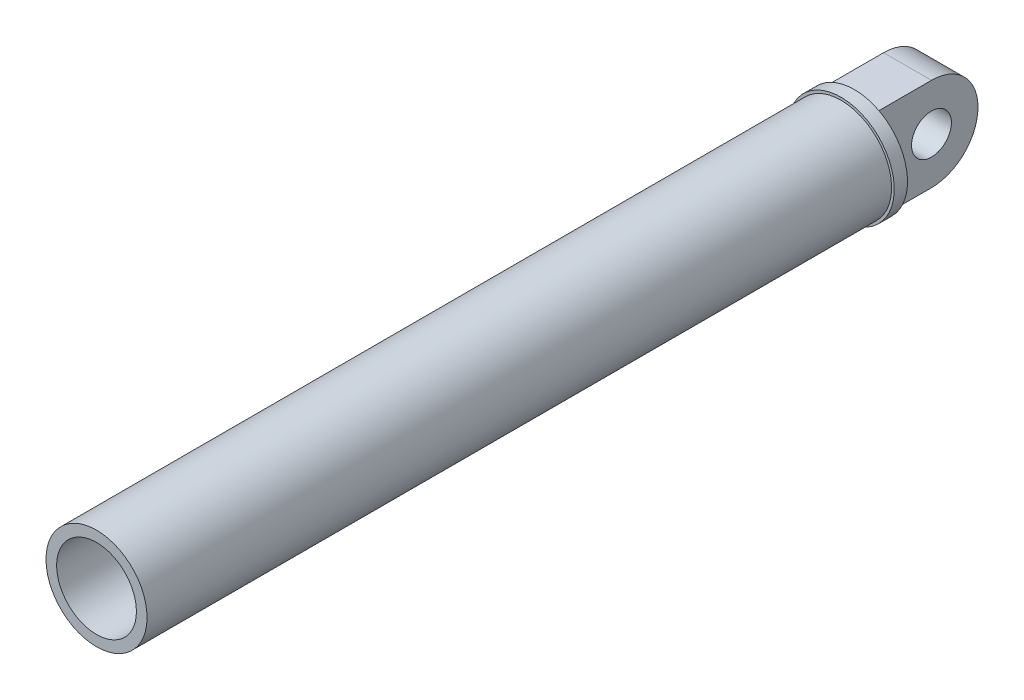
from build123d import *

# Parameters (mm, degrees)
SKETCH_1_R      = 38
SKETCH_1_R_2    = 30
EXTRUDE_1_DEPTH = 560
SKETCH_2_R      = 40
EXTRUDE_2_DEPTH = 10
SKETCH_3_R      = 15
EXTRUDE_3_DEPTH = 18
SKETCH_4_R      = 30
EXTRUDE_4_DEPTH = 15


with BuildPart() as part:
    # Sketch 1 → Extrude 1 (new body)
    with BuildSketch(Plane.XY):
        Circle(SKETCH_1_R)
        Circle(SKETCH_1_R_2, mode=Mode.SUBTRACT)
    extrude(amount=EXTRUDE_1_DEPTH)

    # Sketch 2 → Extrude 2 (add)
    with BuildSketch(Plane(origin=(0, 0, 0), x_dir=(-1, 0, 0), z_dir=(0, 0, -1))):
        Circle(SKETCH_2_R)
    extrude(amount=EXTRUDE_2_DEPTH)

    # Sketch 3 → Extrude 3 (add, symmetric)
    with BuildSketch(Plane(origin=(0, 0, 0), x_dir=(0, 0, -1), z_dir=(1, 0, 0))):
        with BuildLine():
            Line((50, 35), (10, 35))
            Line((10, 35), (10, -35))
            Line((10, -35), (50, -35))
            ThreePointArc((50, -35), (85, 0), (50, 35))
        make_face()
        with Locations((50, 0)):
            Circle(SKETCH_3_R, mode=Mode.SUBTRACT)
    extrude(amount=EXTRUDE_3_DEPTH, both=True)

    # Sketch 4 → Extrude 4 (add)
    with BuildSketch(Plane.XY):
        Circle(SKETCH_4_R)
    extrude(amount=EXTRUDE_4_DEPTH)


solid = part.part
